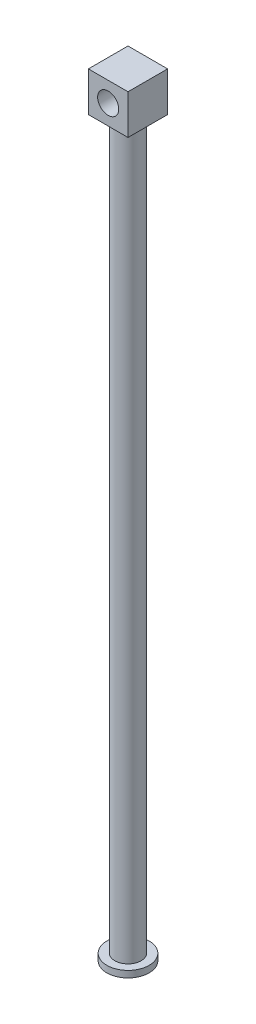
ISO-10303-21;
HEADER;
FILE_DESCRIPTION(('STEP AP214'),'2;1');
FILE_NAME('part.step','',(''),(''),'','','');
FILE_SCHEMA(('AUTOMOTIVE_DESIGN { 1 0 10303 214 1 1 1 1 }'));
ENDSEC;
DATA;
#1=APPLICATION_CONTEXT('core data for automotive mechanical design processes');
#2=APPLICATION_PROTOCOL_DEFINITION('international standard','automotive_design',2000,#1);
#3=PRODUCT_CONTEXT('',#1,'mechanical');
#4=PRODUCT('Part','Part','',(#3));
#5=PRODUCT_RELATED_PRODUCT_CATEGORY('part','',(#4));
#6=PRODUCT_DEFINITION_FORMATION('','',#4);
#7=PRODUCT_DEFINITION_CONTEXT('part definition',#1,'design');
#8=PRODUCT_DEFINITION('design','',#6,#7);
#9=PRODUCT_DEFINITION_SHAPE('','',#8);
#10=(LENGTH_UNIT() NAMED_UNIT(*) SI_UNIT(.MILLI.,.METRE.));
#11=(NAMED_UNIT(*) PLANE_ANGLE_UNIT() SI_UNIT($,.RADIAN.));
#12=(NAMED_UNIT(*) SI_UNIT($,.STERADIAN.) SOLID_ANGLE_UNIT());
#13=UNCERTAINTY_MEASURE_WITH_UNIT(LENGTH_MEASURE(1.E-05),#10,'distance_accuracy_value','');
#14=(GEOMETRIC_REPRESENTATION_CONTEXT(3) GLOBAL_UNCERTAINTY_ASSIGNED_CONTEXT((#13)) GLOBAL_UNIT_ASSIGNED_CONTEXT((#10,
#11,#12)) REPRESENTATION_CONTEXT('',''));
#15=CARTESIAN_POINT('',(0.,0.,0.));
#16=DIRECTION('',(0.,0.,1.));
#17=DIRECTION('',(1.,0.,0.));
#18=AXIS2_PLACEMENT_3D('',#15,#16,#17);
#19=CARTESIAN_POINT('',(0.,-7.60316295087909,0.));
#20=DIRECTION('',(0.,-1.,0.));
#21=DIRECTION('',(0.,0.,-1.));
#22=AXIS2_PLACEMENT_3D('',#19,#20,#21);
#23=CYLINDRICAL_SURFACE('',#22,16.);
#24=CARTESIAN_POINT('',(0.,-2.61748232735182,0.));
#25=DIRECTION('',(0.,-1.,0.));
#26=DIRECTION('',(0.,0.,-1.));
#27=AXIS2_PLACEMENT_3D('',#24,#25,#26);
#28=CIRCLE('',#27,16.);
#29=CARTESIAN_POINT('',(0.,-2.61748232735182,-16.));
#30=VERTEX_POINT('',#29);
#31=EDGE_CURVE('E11',#30,#30,#28,.T.);
#32=ORIENTED_EDGE('',*,*,#31,.F.);
#33=EDGE_LOOP('',(#32));
#34=FACE_BOUND('',#33,.T.);
#35=CARTESIAN_POINT('',(0.,2.36819829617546,0.));
#36=DIRECTION('',(0.,-1.,0.));
#37=DIRECTION('',(0.,0.,-1.));
#38=AXIS2_PLACEMENT_3D('',#35,#36,#37);
#39=CIRCLE('',#38,16.);
#40=CARTESIAN_POINT('',(0.,2.36819829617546,-16.));
#41=VERTEX_POINT('',#40);
#42=EDGE_CURVE('E111',#41,#41,#39,.T.);
#43=ORIENTED_EDGE('',*,*,#42,.T.);
#44=EDGE_LOOP('',(#43));
#45=FACE_BOUND('',#44,.T.);
#46=ADVANCED_FACE('F26',(#34,#45),#23,.T.);
#47=CARTESIAN_POINT('',(-16.,-2.61748232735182,0.));
#48=DIRECTION('',(0.,1.,0.));
#49=DIRECTION('',(0.,0.,1.));
#50=AXIS2_PLACEMENT_3D('',#47,#48,#49);
#51=PLANE('',#50);
#52=ORIENTED_EDGE('',*,*,#31,.T.);
#53=EDGE_LOOP('',(#52));
#54=FACE_BOUND('',#53,.T.);
#55=ADVANCED_FACE('F122',(#54),#51,.F.);
#56=CARTESIAN_POINT('',(0.,-7.60316295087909,0.));
#57=DIRECTION('',(0.,-1.,0.));
#58=DIRECTION('',(0.,0.,-1.));
#59=AXIS2_PLACEMENT_3D('',#56,#57,#58);
#60=CYLINDRICAL_SURFACE('',#59,10.);
#61=CARTESIAN_POINT('',(0.,2.36819829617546,0.));
#62=DIRECTION('',(0.,-1.,0.));
#63=DIRECTION('',(0.,0.,-1.));
#64=AXIS2_PLACEMENT_3D('',#61,#62,#63);
#65=CIRCLE('',#64,10.);
#66=CARTESIAN_POINT('',(0.,2.36819829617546,-10.));
#67=VERTEX_POINT('',#66);
#68=EDGE_CURVE('E34',#67,#67,#65,.T.);
#69=ORIENTED_EDGE('',*,*,#68,.F.);
#70=EDGE_LOOP('',(#69));
#71=FACE_BOUND('',#70,.T.);
#72=CARTESIAN_POINT('',(0.,552.368198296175,0.));
#73=DIRECTION('',(0.,-1.,0.));
#74=DIRECTION('',(0.,0.,-1.));
#75=AXIS2_PLACEMENT_3D('',#72,#73,#74);
#76=CIRCLE('',#75,10.);
#77=CARTESIAN_POINT('',(0.,552.368198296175,-10.));
#78=VERTEX_POINT('',#77);
#79=EDGE_CURVE('E85',#78,#78,#76,.T.);
#80=ORIENTED_EDGE('',*,*,#79,.T.);
#81=EDGE_LOOP('',(#80));
#82=FACE_BOUND('',#81,.T.);
#83=ADVANCED_FACE('F119',(#71,#82),#60,.T.);
#84=CARTESIAN_POINT('',(-16.,2.36819829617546,0.));
#85=DIRECTION('',(0.,-1.,0.));
#86=DIRECTION('',(0.,0.,-1.));
#87=AXIS2_PLACEMENT_3D('',#84,#85,#86);
#88=PLANE('',#87);
#89=ORIENTED_EDGE('',*,*,#42,.F.);
#90=EDGE_LOOP('',(#89));
#91=FACE_BOUND('',#90,.T.);
#92=ORIENTED_EDGE('',*,*,#68,.T.);
#93=EDGE_LOOP('',(#92));
#94=FACE_BOUND('',#93,.T.);
#95=ADVANCED_FACE('F117',(#91,#94),#88,.F.);
#96=CARTESIAN_POINT('',(15.,552.368198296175,15.));
#97=DIRECTION('',(0.,-1.,0.));
#98=DIRECTION('',(0.,0.,-1.));
#99=AXIS2_PLACEMENT_3D('',#96,#97,#98);
#100=PLANE('',#99);
#101=DIRECTION('',(0.,0.,-1.));
#102=VECTOR('',#101,1.);
#103=CARTESIAN_POINT('',(15.,552.368198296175,-15.));
#104=LINE('',#103,#102);
#105=CARTESIAN_POINT('',(15.,552.368198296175,15.));
#106=VERTEX_POINT('',#105);
#107=CARTESIAN_POINT('',(15.,552.368198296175,-15.));
#108=VERTEX_POINT('',#107);
#109=EDGE_CURVE('E73',#106,#108,#104,.T.);
#110=ORIENTED_EDGE('',*,*,#109,.F.);
#111=DIRECTION('',(1.,0.,0.));
#112=VECTOR('',#111,1.);
#113=CARTESIAN_POINT('',(15.,552.368198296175,15.));
#114=LINE('',#113,#112);
#115=CARTESIAN_POINT('',(-15.,552.368198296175,15.));
#116=VERTEX_POINT('',#115);
#117=EDGE_CURVE('E97',#116,#106,#114,.T.);
#118=ORIENTED_EDGE('',*,*,#117,.F.);
#119=DIRECTION('',(0.,0.,1.));
#120=VECTOR('',#119,1.);
#121=CARTESIAN_POINT('',(-15.,552.368198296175,-15.));
#122=LINE('',#121,#120);
#123=CARTESIAN_POINT('',(-15.,552.368198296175,-15.));
#124=VERTEX_POINT('',#123);
#125=EDGE_CURVE('E74',#124,#116,#122,.T.);
#126=ORIENTED_EDGE('',*,*,#125,.F.);
#127=DIRECTION('',(-1.,0.,0.));
#128=VECTOR('',#127,1.);
#129=CARTESIAN_POINT('',(15.,552.368198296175,-15.));
#130=LINE('',#129,#128);
#131=EDGE_CURVE('E67',#108,#124,#130,.T.);
#132=ORIENTED_EDGE('',*,*,#131,.F.);
#133=EDGE_LOOP('',(#110,#118,#126,#132));
#134=FACE_BOUND('',#133,.T.);
#135=ORIENTED_EDGE('',*,*,#79,.F.);
#136=EDGE_LOOP('',(#135));
#137=FACE_BOUND('',#136,.T.);
#138=ADVANCED_FACE('F69',(#134,#137),#100,.T.);
#139=CARTESIAN_POINT('',(15.,582.368198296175,-15.));
#140=DIRECTION('',(-1.,0.,0.));
#141=DIRECTION('',(0.,0.,1.));
#142=AXIS2_PLACEMENT_3D('',#139,#140,#141);
#143=PLANE('',#142);
#144=ORIENTED_EDGE('',*,*,#109,.T.);
#145=DIRECTION('',(0.,-1.,0.));
#146=VECTOR('',#145,1.);
#147=CARTESIAN_POINT('',(15.,582.368198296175,-15.));
#148=LINE('',#147,#146);
#149=CARTESIAN_POINT('',(15.,582.368198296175,-15.));
#150=VERTEX_POINT('',#149);
#151=EDGE_CURVE('E80',#150,#108,#148,.T.);
#152=ORIENTED_EDGE('',*,*,#151,.F.);
#153=DIRECTION('',(0.,0.,-1.));
#154=VECTOR('',#153,1.);
#155=CARTESIAN_POINT('',(15.,582.368198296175,-15.));
#156=LINE('',#155,#154);
#157=CARTESIAN_POINT('',(15.,582.368198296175,15.));
#158=VERTEX_POINT('',#157);
#159=EDGE_CURVE('E99',#158,#150,#156,.T.);
#160=ORIENTED_EDGE('',*,*,#159,.F.);
#161=DIRECTION('',(0.,-1.,0.));
#162=VECTOR('',#161,1.);
#163=CARTESIAN_POINT('',(15.,582.368198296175,15.));
#164=LINE('',#163,#162);
#165=EDGE_CURVE('E90',#158,#106,#164,.T.);
#166=ORIENTED_EDGE('',*,*,#165,.T.);
#167=EDGE_LOOP('',(#144,#152,#160,#166));
#168=FACE_BOUND('',#167,.T.);
#169=ADVANCED_FACE('F89',(#168),#143,.F.);
#170=CARTESIAN_POINT('',(15.,582.368198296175,-15.));
#171=DIRECTION('',(0.,0.,1.));
#172=DIRECTION('',(1.,0.,0.));
#173=AXIS2_PLACEMENT_3D('',#170,#171,#172);
#174=PLANE('',#173);
#175=CARTESIAN_POINT('',(0.,567.368198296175,-15.));
#176=DIRECTION('',(0.,0.,-1.));
#177=DIRECTION('',(-1.,0.,0.));
#178=AXIS2_PLACEMENT_3D('',#175,#176,#177);
#179=CIRCLE('',#178,8.00000000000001);
#180=CARTESIAN_POINT('',(-8.00000000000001,567.368198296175,-15.));
#181=VERTEX_POINT('',#180);
#182=EDGE_CURVE('E93',#181,#181,#179,.T.);
#183=ORIENTED_EDGE('',*,*,#182,.F.);
#184=EDGE_LOOP('',(#183));
#185=FACE_BOUND('',#184,.T.);
#186=ORIENTED_EDGE('',*,*,#131,.T.);
#187=DIRECTION('',(0.,-1.,0.));
#188=VECTOR('',#187,1.);
#189=CARTESIAN_POINT('',(-15.,582.368198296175,-15.));
#190=LINE('',#189,#188);
#191=CARTESIAN_POINT('',(-15.,582.368198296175,-15.));
#192=VERTEX_POINT('',#191);
#193=EDGE_CURVE('E86',#192,#124,#190,.T.);
#194=ORIENTED_EDGE('',*,*,#193,.F.);
#195=DIRECTION('',(-1.,0.,0.));
#196=VECTOR('',#195,1.);
#197=CARTESIAN_POINT('',(15.,582.368198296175,-15.));
#198=LINE('',#197,#196);
#199=EDGE_CURVE('E82',#150,#192,#198,.T.);
#200=ORIENTED_EDGE('',*,*,#199,.F.);
#201=ORIENTED_EDGE('',*,*,#151,.T.);
#202=EDGE_LOOP('',(#186,#194,#200,#201));
#203=FACE_BOUND('',#202,.T.);
#204=ADVANCED_FACE('F81',(#185,#203),#174,.F.);
#205=CARTESIAN_POINT('',(-15.,582.368198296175,-15.));
#206=DIRECTION('',(1.,0.,0.));
#207=DIRECTION('',(0.,0.,-1.));
#208=AXIS2_PLACEMENT_3D('',#205,#206,#207);
#209=PLANE('',#208);
#210=ORIENTED_EDGE('',*,*,#125,.T.);
#211=DIRECTION('',(0.,-1.,0.));
#212=VECTOR('',#211,1.);
#213=CARTESIAN_POINT('',(-15.,582.368198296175,15.));
#214=LINE('',#213,#212);
#215=CARTESIAN_POINT('',(-15.,582.368198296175,15.));
#216=VERTEX_POINT('',#215);
#217=EDGE_CURVE('E105',#216,#116,#214,.T.);
#218=ORIENTED_EDGE('',*,*,#217,.F.);
#219=DIRECTION('',(0.,0.,1.));
#220=VECTOR('',#219,1.);
#221=CARTESIAN_POINT('',(-15.,582.368198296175,-15.));
#222=LINE('',#221,#220);
#223=EDGE_CURVE('E46',#192,#216,#222,.T.);
#224=ORIENTED_EDGE('',*,*,#223,.F.);
#225=ORIENTED_EDGE('',*,*,#193,.T.);
#226=EDGE_LOOP('',(#210,#218,#224,#225));
#227=FACE_BOUND('',#226,.T.);
#228=ADVANCED_FACE('F150',(#227),#209,.F.);
#229=CARTESIAN_POINT('',(15.,582.368198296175,15.));
#230=DIRECTION('',(0.,0.,-1.));
#231=DIRECTION('',(-1.,0.,0.));
#232=AXIS2_PLACEMENT_3D('',#229,#230,#231);
#233=PLANE('',#232);
#234=CARTESIAN_POINT('',(0.,567.368198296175,15.));
#235=DIRECTION('',(0.,0.,-1.));
#236=DIRECTION('',(-1.,0.,0.));
#237=AXIS2_PLACEMENT_3D('',#234,#235,#236);
#238=CIRCLE('',#237,8.00000000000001);
#239=CARTESIAN_POINT('',(-8.00000000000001,567.368198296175,15.));
#240=VERTEX_POINT('',#239);
#241=EDGE_CURVE('E29',#240,#240,#238,.T.);
#242=ORIENTED_EDGE('',*,*,#241,.T.);
#243=EDGE_LOOP('',(#242));
#244=FACE_BOUND('',#243,.T.);
#245=ORIENTED_EDGE('',*,*,#117,.T.);
#246=ORIENTED_EDGE('',*,*,#165,.F.);
#247=DIRECTION('',(1.,0.,0.));
#248=VECTOR('',#247,1.);
#249=CARTESIAN_POINT('',(15.,582.368198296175,15.));
#250=LINE('',#249,#248);
#251=EDGE_CURVE('E41',#216,#158,#250,.T.);
#252=ORIENTED_EDGE('',*,*,#251,.F.);
#253=ORIENTED_EDGE('',*,*,#217,.T.);
#254=EDGE_LOOP('',(#245,#246,#252,#253));
#255=FACE_BOUND('',#254,.T.);
#256=ADVANCED_FACE('F154',(#244,#255),#233,.F.);
#257=CARTESIAN_POINT('',(15.,582.368198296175,15.));
#258=DIRECTION('',(0.,-1.,0.));
#259=DIRECTION('',(0.,0.,-1.));
#260=AXIS2_PLACEMENT_3D('',#257,#258,#259);
#261=PLANE('',#260);
#262=ORIENTED_EDGE('',*,*,#159,.T.);
#263=ORIENTED_EDGE('',*,*,#199,.T.);
#264=ORIENTED_EDGE('',*,*,#223,.T.);
#265=ORIENTED_EDGE('',*,*,#251,.T.);
#266=EDGE_LOOP('',(#262,#263,#264,#265));
#267=FACE_BOUND('',#266,.T.);
#268=ADVANCED_FACE('F157',(#267),#261,.F.);
#269=CARTESIAN_POINT('',(0.,567.368198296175,16.));
#270=DIRECTION('',(0.,0.,-1.));
#271=DIRECTION('',(-1.,0.,0.));
#272=AXIS2_PLACEMENT_3D('',#269,#270,#271);
#273=CYLINDRICAL_SURFACE('',#272,8.00000000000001);
#274=ORIENTED_EDGE('',*,*,#182,.T.);
#275=EDGE_LOOP('',(#274));
#276=FACE_BOUND('',#275,.T.);
#277=ORIENTED_EDGE('',*,*,#241,.F.);
#278=EDGE_LOOP('',(#277));
#279=FACE_BOUND('',#278,.T.);
#280=ADVANCED_FACE('F160',(#276,#279),#273,.F.);
#281=CLOSED_SHELL('',(#46,#55,#83,#95,#138,#169,#204,#228,#256,#268,#280));
#282=MANIFOLD_SOLID_BREP('B2',#281);
#283=ADVANCED_BREP_SHAPE_REPRESENTATION('',(#18,#282),#14);
#284=SHAPE_DEFINITION_REPRESENTATION(#9,#283);
ENDSEC;
END-ISO-10303-21;
